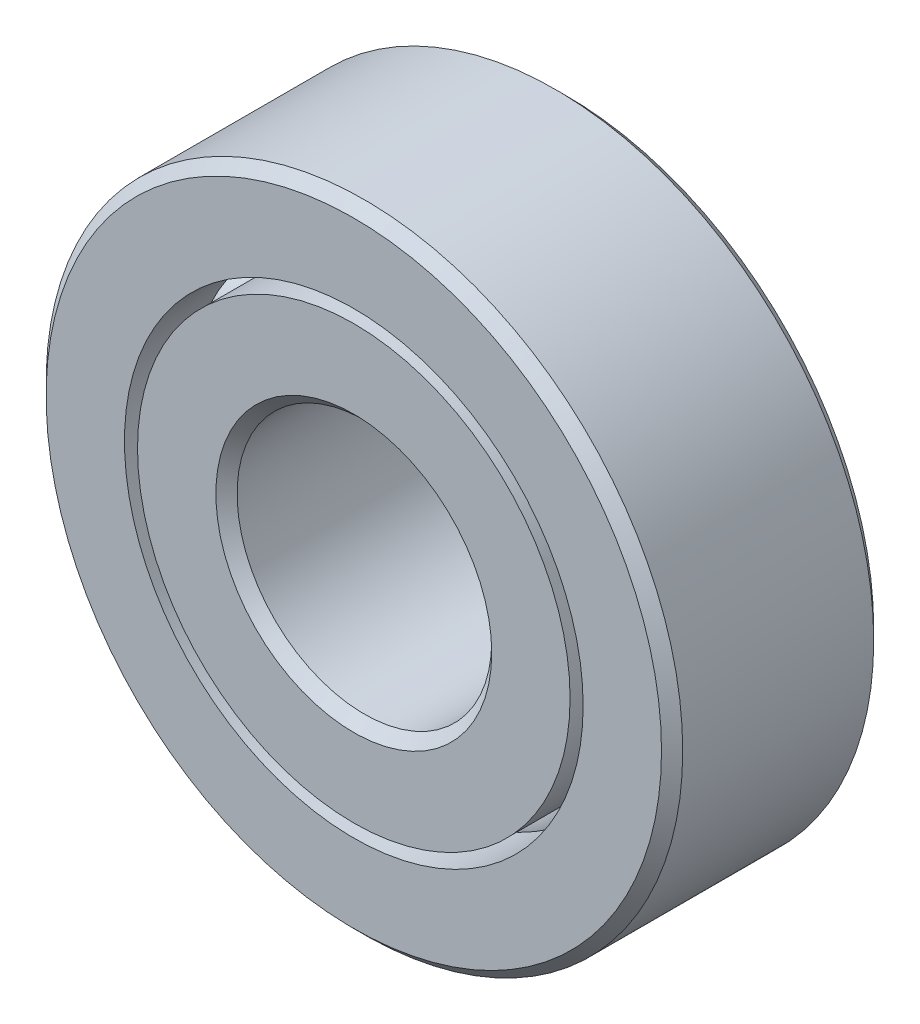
from build123d import *

# Parameters (mm, degrees)
CIRPATTERN1_COUNT = 16


with BuildPart() as part:
    # Sketch1 → Revolve1 (revolve)
    with BuildSketch(Plane(origin=(0, 0, 0), x_dir=(0, 0, -1), z_dir=(1, 0, 0)), mode=Mode.PRIVATE) as revolve1_sk:
        with BuildLine():
            Line((2.25, 7.5), (-2.25, 7.5))
            Line((-2.25, 7.5), (-2.5, 7.25))
            Line((-2.5, 7.25), (-2.5, 5.403846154))
            Line((-2.5, 5.403846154), (-0.988094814, 5.403846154))
            ThreePointArc((-0.988094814, 5.403846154), (0, 6.25), (0.988094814, 5.403846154))
            Line((0.988094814, 5.403846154), (2.5, 5.403846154))
            Line((2.5, 5.403846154), (2.5, 7.25))
            Line((2.5, 7.25), (2.25, 7.5))
        make_face()
    revolve(revolve1_sk.sketch.rotate(Axis((0, 0, 2.5), (0, 0, -1)), 90), axis=Axis((0, 0, 2.5), (0, 0, -1)))


with BuildPart() as body_2:
    # Sketch3 → Revolve3 (revolve)
    with BuildSketch(Plane(origin=(0, 0, 0), x_dir=(0, 0, -1), z_dir=(1, 0, 0)), mode=Mode.PRIVATE) as revolve3_sk:
        with BuildLine():
            Line((-2.5, 5.096153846), (-0.988094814, 5.096153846))
            ThreePointArc((-0.988094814, 5.096153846), (0, 4.25), (0.988094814, 5.096153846))
            Line((0.988094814, 5.096153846), (2.5, 5.096153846))
            Line((2.5, 5.096153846), (2.5, 3.25))
            Line((2.5, 3.25), (2.25, 3))
            Line((2.25, 3), (-2.25, 3))
            Line((-2.25, 3), (-2.5, 3.25))
            Line((-2.5, 3.25), (-2.5, 5.096153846))
        make_face()
    revolve(revolve3_sk.sketch.rotate(Axis((0, 0, 2.5), (0, 0, -1)), 90), axis=Axis((0, 0, 2.5), (0, 0, -1)))


with BuildPart() as body_3:
    # Sketch4 → Revolve4 (revolve)
    with BuildSketch(Plane(origin=(0, 0, 0), x_dir=(0, 0, -1), z_dir=(1, 0, 0))):
        with BuildLine():
            Line((-1, 5.25), (1, 5.25))
            ThreePointArc((1, 5.25), (0, 6.25), (-1, 5.25))
        make_face()
    revolve(axis=Axis((0, 5.25, 1), (0, 0, -1)))


with BuildPart() as cirpattern1_1:
    # CirPattern1: pattern copy
    add(body_3.part.rotate(Axis((0, 0, 0), (0, 0, 1)), 1 * 360 / CIRPATTERN1_COUNT))


with BuildPart() as cirpattern1_2:
    # CirPattern1: pattern copy
    add(body_3.part.rotate(Axis((0, 0, 0), (0, 0, 1)), 2 * 360 / CIRPATTERN1_COUNT))


with BuildPart() as cirpattern1_3:
    # CirPattern1: pattern copy
    add(body_3.part.rotate(Axis((0, 0, 0), (0, 0, 1)), 3 * 360 / CIRPATTERN1_COUNT))


with BuildPart() as cirpattern1_4:
    # CirPattern1: pattern copy
    add(body_3.part.rotate(Axis((0, 0, 0), (0, 0, 1)), 4 * 360 / CIRPATTERN1_COUNT))


with BuildPart() as cirpattern1_5:
    # CirPattern1: pattern copy
    add(body_3.part.rotate(Axis((0, 0, 0), (0, 0, 1)), 5 * 360 / CIRPATTERN1_COUNT))


with BuildPart() as cirpattern1_6:
    # CirPattern1: pattern copy
    add(body_3.part.rotate(Axis((0, 0, 0), (0, 0, 1)), 6 * 360 / CIRPATTERN1_COUNT))


with BuildPart() as cirpattern1_7:
    # CirPattern1: pattern copy
    add(body_3.part.rotate(Axis((0, 0, 0), (0, 0, 1)), 7 * 360 / CIRPATTERN1_COUNT))


with BuildPart() as cirpattern1_8:
    # CirPattern1: pattern copy
    add(body_3.part.rotate(Axis((0, 0, 0), (0, 0, 1)), 8 * 360 / CIRPATTERN1_COUNT))


with BuildPart() as cirpattern1_9:
    # CirPattern1: pattern copy
    add(body_3.part.rotate(Axis((0, 0, 0), (0, 0, 1)), 9 * 360 / CIRPATTERN1_COUNT))


with BuildPart() as cirpattern1_10:
    # CirPattern1: pattern copy
    add(body_3.part.rotate(Axis((0, 0, 0), (0, 0, 1)), 10 * 360 / CIRPATTERN1_COUNT))


with BuildPart() as cirpattern1_11:
    # CirPattern1: pattern copy
    add(body_3.part.rotate(Axis((0, 0, 0), (0, 0, 1)), 11 * 360 / CIRPATTERN1_COUNT))


with BuildPart() as cirpattern1_12:
    # CirPattern1: pattern copy
    add(body_3.part.rotate(Axis((0, 0, 0), (0, 0, 1)), 12 * 360 / CIRPATTERN1_COUNT))


with BuildPart() as cirpattern1_13:
    # CirPattern1: pattern copy
    add(body_3.part.rotate(Axis((0, 0, 0), (0, 0, 1)), 13 * 360 / CIRPATTERN1_COUNT))


with BuildPart() as cirpattern1_14:
    # CirPattern1: pattern copy
    add(body_3.part.rotate(Axis((0, 0, 0), (0, 0, 1)), 14 * 360 / CIRPATTERN1_COUNT))


with BuildPart() as cirpattern1_15:
    # CirPattern1: pattern copy
    add(body_3.part.rotate(Axis((0, 0, 0), (0, 0, 1)), 15 * 360 / CIRPATTERN1_COUNT))


solid = Compound([part.part, body_2.part, body_3.part, cirpattern1_1.part, cirpattern1_2.part, cirpattern1_3.part, cirpattern1_4.part, cirpattern1_5.part, cirpattern1_6.part, cirpattern1_7.part, cirpattern1_8.part, cirpattern1_9.part, cirpattern1_10.part, cirpattern1_11.part, cirpattern1_12.part, cirpattern1_13.part, cirpattern1_14.part, cirpattern1_15.part])
